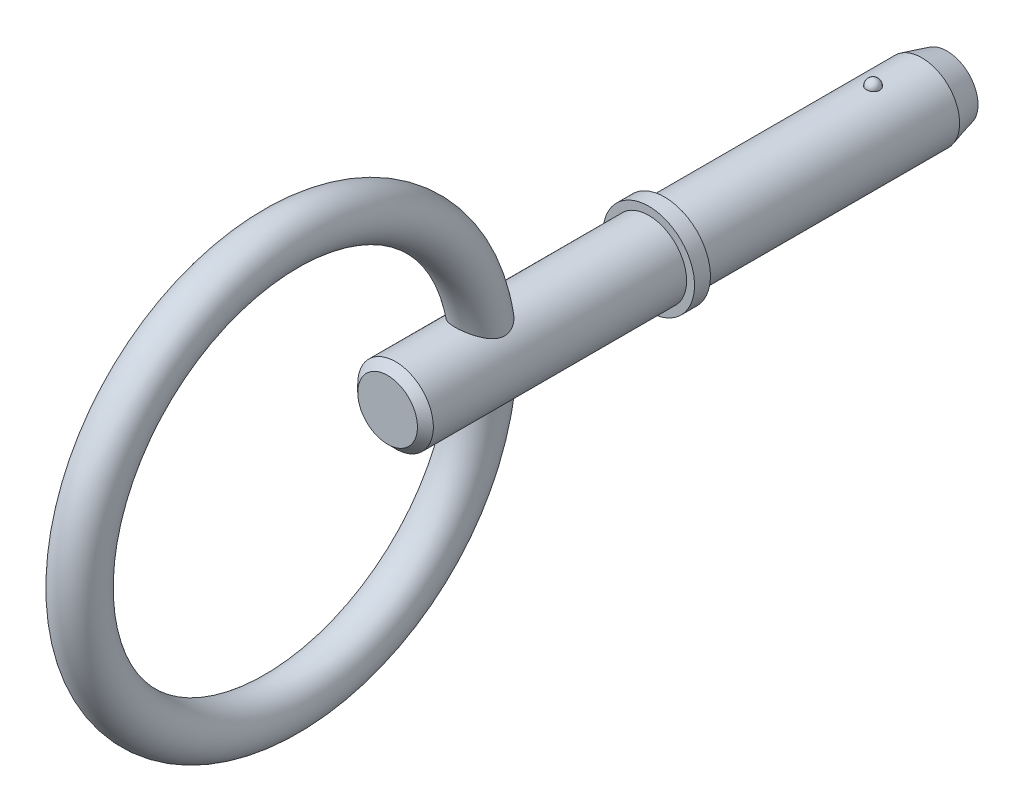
from build123d import *

# Parameters (mm, degrees)
SKETCH2_R           = 2.38
BOSS_EXTRUDE1_DEPTH = 12.7
BOSS_EXTRUDE2_START = 5.08
SKETCH3_R           = 2.38
BOSS_EXTRUDE2_DEPTH = 5.08
CHAMFER1_SIZE       = 1.586
CHAMFER1_SIZE2      = 0.424967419
SKETCH20_W          = 1
SKETCH20_H          = 2.88
SKETCH21_R          = 2.38
BOSS_EXTRUDE3_DEPTH = 17.45
CHAMFER2_SIZE       = 0.5
SKETCH24_R          = 1.5


with BuildPart() as part:
    # Sketch2 → Boss-Extrude1 (new body)
    with BuildSketch(Plane.XY):
        Circle(SKETCH2_R)
    extrude(amount=BOSS_EXTRUDE1_DEPTH)

    # Sketch3 → Boss-Extrude2 (add)
    with BuildSketch(Plane(origin=(0, 0, 0), x_dir=(-1, 0, 0), z_dir=(0, 0, -1)).offset(BOSS_EXTRUDE2_START)):
        Circle(SKETCH3_R)
    extrude(amount=-BOSS_EXTRUDE2_DEPTH)

    # Chamfer1
    chamfer1_edges = [part.edges().sort_by_distance(p)[0] for p in [
        (2.38, 0, -5.08),
    ]]
    chamfer1_side = [part.faces().sort_by_distance(p)[0] for p in [
        (2.38, 0, -2.54),
    ]]
    chamfer(chamfer1_edges, length=CHAMFER1_SIZE, length2=CHAMFER1_SIZE2, reference=chamfer1_side[0])

    # Sketch18 → Revolve1 (revolve)
    with BuildSketch(Plane(origin=(0, 0, 0), x_dir=(0, 0, -1), z_dir=(1, 0, 0))):
        with BuildLine():
            Line((0.42, 2.8), (0.42, 1.96))
            ThreePointArc((0.42, 1.96), (0, 2.38), (0.42, 2.8))
        make_face()
    revolve(axis=Axis((0, 2.8, -0.42), (0, -1, 0)))

    # Sketch20 → Revolve2 (revolve)
    with BuildSketch(Plane(origin=(0, 0, 0), x_dir=(0, 0, -1), z_dir=(1, 0, 0)), mode=Mode.PRIVATE) as revolve2_sk:
        with Locations((-13.2, 1.44)):
            Rectangle(SKETCH20_W, SKETCH20_H)
    revolve(revolve2_sk.sketch.rotate(Axis((0, 0, 33.728787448), (0, 0, 1)), 90), axis=Axis((0, 0, 33.728787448), (0, 0, 1)))

    # Sketch21 → Boss-Extrude3 (add)
    with BuildSketch(Plane(origin=(0, 0, 12.7), x_dir=(-1, 0, 0), z_dir=(0, 0, -1))):
        Circle(SKETCH21_R)
    extrude(amount=-BOSS_EXTRUDE3_DEPTH)

    # Chamfer2
    chamfer2_edges = [part.edges().sort_by_distance(p)[0] for p in [
        (2.38, 0, 30.15),
    ]]
    chamfer(chamfer2_edges, length=CHAMFER2_SIZE)

    # Sweep1: sweep along a path in Sketch23
    with BuildLine(Plane(origin=(0, 0, 0), x_dir=(0, 0, -1), z_dir=(1, 0, 0))) as sweep1_path:
        CenterArc((-36.85, 0), 12.7, 0, 360)
    # Sketch24 → Sweep1 (sweep)
    with BuildSketch(Plane(origin=(0, 0, 0), x_dir=(1, 0, 0), z_dir=(0, 1, 0))):
        with Locations((0, -24.15)):
            Circle(SKETCH24_R)
    sweep(path=sweep1_path.line)


solid = part.part
